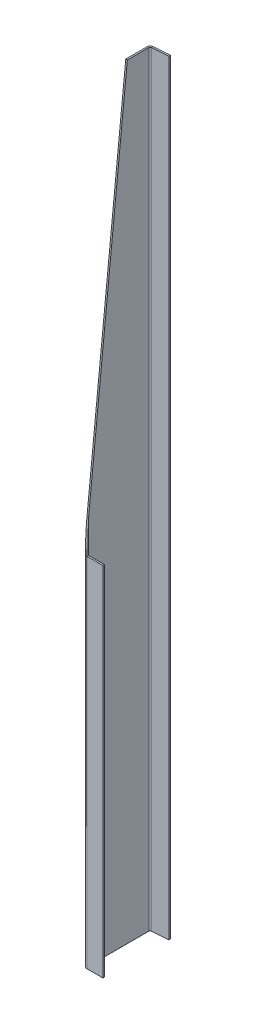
ISO-10303-21;
HEADER;
FILE_DESCRIPTION(('STEP AP214'),'2;1');
FILE_NAME('part.step','',(''),(''),'','','');
FILE_SCHEMA(('AUTOMOTIVE_DESIGN { 1 0 10303 214 1 1 1 1 }'));
ENDSEC;
DATA;
#1=APPLICATION_CONTEXT('core data for automotive mechanical design processes');
#2=APPLICATION_PROTOCOL_DEFINITION('international standard','automotive_design',2000,#1);
#3=PRODUCT_CONTEXT('',#1,'mechanical');
#4=PRODUCT('Part','Part','',(#3));
#5=PRODUCT_RELATED_PRODUCT_CATEGORY('part','',(#4));
#6=PRODUCT_DEFINITION_FORMATION('','',#4);
#7=PRODUCT_DEFINITION_CONTEXT('part definition',#1,'design');
#8=PRODUCT_DEFINITION('design','',#6,#7);
#9=PRODUCT_DEFINITION_SHAPE('','',#8);
#10=(LENGTH_UNIT() NAMED_UNIT(*) SI_UNIT(.MILLI.,.METRE.));
#11=(NAMED_UNIT(*) PLANE_ANGLE_UNIT() SI_UNIT($,.RADIAN.));
#12=(NAMED_UNIT(*) SI_UNIT($,.STERADIAN.) SOLID_ANGLE_UNIT());
#13=UNCERTAINTY_MEASURE_WITH_UNIT(LENGTH_MEASURE(1.E-05),#10,'distance_accuracy_value','');
#14=(GEOMETRIC_REPRESENTATION_CONTEXT(3) GLOBAL_UNCERTAINTY_ASSIGNED_CONTEXT((#13)) GLOBAL_UNIT_ASSIGNED_CONTEXT((#10,
#11,#12)) REPRESENTATION_CONTEXT('',''));
#15=CARTESIAN_POINT('',(0.,0.,0.));
#16=DIRECTION('',(0.,0.,1.));
#17=DIRECTION('',(1.,0.,0.));
#18=AXIS2_PLACEMENT_3D('',#15,#16,#17);
#19=CARTESIAN_POINT('',(12.7,3048.,-6.35));
#20=DIRECTION('',(0.,1.,0.));
#21=DIRECTION('',(0.,0.,1.));
#22=AXIS2_PLACEMENT_3D('',#19,#20,#21);
#23=PLANE('',#22);
#24=DIRECTION('',(0.,0.,-1.));
#25=VECTOR('',#24,1.);
#26=CARTESIAN_POINT('',(0.,3048.,0.));
#27=LINE('',#26,#25);
#28=CARTESIAN_POINT('',(0.,3048.,-167.240443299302));
#29=VERTEX_POINT('',#28);
#30=CARTESIAN_POINT('',(0.,3048.,-251.682058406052));
#31=VERTEX_POINT('',#30);
#32=EDGE_CURVE('E131',#29,#31,#27,.T.);
#33=ORIENTED_EDGE('',*,*,#32,.F.);
#34=DIRECTION('',(-1.,0.,0.));
#35=VECTOR('',#34,1.);
#36=CARTESIAN_POINT('',(0.,3048.,-167.240443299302));
#37=LINE('',#36,#35);
#38=CARTESIAN_POINT('',(6.35,3048.,-167.240443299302));
#39=VERTEX_POINT('',#38);
#40=EDGE_CURVE('E282',#29,#39,#37,.F.);
#41=ORIENTED_EDGE('',*,*,#40,.T.);
#42=DIRECTION('',(0.,0.,-1.));
#43=VECTOR('',#42,1.);
#44=CARTESIAN_POINT('',(6.35,3048.,0.));
#45=LINE('',#44,#43);
#46=CARTESIAN_POINT('',(6.35,3048.,-251.682058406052));
#47=VERTEX_POINT('',#46);
#48=EDGE_CURVE('E142',#39,#47,#45,.T.);
#49=ORIENTED_EDGE('',*,*,#48,.T.);
#50=DIRECTION('',(-1.,0.,0.));
#51=VECTOR('',#50,1.);
#52=CARTESIAN_POINT('',(6.35,3048.,-251.682058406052));
#53=LINE('',#52,#51);
#54=EDGE_CURVE('E146',#47,#31,#53,.T.);
#55=ORIENTED_EDGE('',*,*,#54,.T.);
#56=EDGE_LOOP('',(#33,#41,#49,#55));
#57=FACE_BOUND('',#56,.T.);
#58=ADVANCED_FACE('F42',(#57),#23,.T.);
#59=CARTESIAN_POINT('',(0.,3048.,0.));
#60=DIRECTION('',(-1.,0.,0.));
#61=DIRECTION('',(0.,0.,1.));
#62=AXIS2_PLACEMENT_3D('',#59,#60,#61);
#63=PLANE('',#62);
#64=DIRECTION('',(0.,-1.,0.));
#65=VECTOR('',#64,1.);
#66=CARTESIAN_POINT('',(0.,3048.,-12.7));
#67=LINE('',#66,#65);
#68=CARTESIAN_POINT('',(0.,1546.13428280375,-12.7000000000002));
#69=VERTEX_POINT('',#68);
#70=CARTESIAN_POINT('',(0.,0.,-12.7));
#71=VERTEX_POINT('',#70);
#72=EDGE_CURVE('E160',#69,#71,#67,.T.);
#73=ORIENTED_EDGE('',*,*,#72,.F.);
#74=DIRECTION('',(0.,-0.994747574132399,0.102358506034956));
#75=VECTOR('',#74,1.);
#76=CARTESIAN_POINT('',(0.,1422.71225682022,0.));
#77=LINE('',#76,#75);
#78=EDGE_CURVE('E139',#29,#69,#77,.T.);
#79=ORIENTED_EDGE('',*,*,#78,.F.);
#80=ORIENTED_EDGE('',*,*,#32,.T.);
#81=DIRECTION('',(0.,-1.,0.));
#82=VECTOR('',#81,1.);
#83=CARTESIAN_POINT('',(0.,3048.,-251.682058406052));
#84=LINE('',#83,#82);
#85=CARTESIAN_POINT('',(0.,0.,-251.682058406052));
#86=VERTEX_POINT('',#85);
#87=EDGE_CURVE('E137',#31,#86,#84,.T.);
#88=ORIENTED_EDGE('',*,*,#87,.T.);
#89=DIRECTION('',(0.,0.,-1.));
#90=VECTOR('',#89,1.);
#91=CARTESIAN_POINT('',(0.,0.,0.));
#92=LINE('',#91,#90);
#93=EDGE_CURVE('E185',#71,#86,#92,.T.);
#94=ORIENTED_EDGE('',*,*,#93,.F.);
#95=EDGE_LOOP('',(#73,#79,#80,#88,#94));
#96=FACE_BOUND('',#95,.T.);
#97=ADVANCED_FACE('F134',(#96),#63,.T.);
#98=CARTESIAN_POINT('',(12.7,3048.,-12.7));
#99=DIRECTION('',(0.,-1.,0.));
#100=DIRECTION('',(0.,0.,-1.));
#101=AXIS2_PLACEMENT_3D('',#98,#99,#100);
#102=CYLINDRICAL_SURFACE('',#101,12.7);
#103=DIRECTION('',(0.,-1.,0.));
#104=VECTOR('',#103,1.);
#105=CARTESIAN_POINT('',(12.7000000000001,3048.,0.));
#106=LINE('',#105,#104);
#107=CARTESIAN_POINT('',(12.7000000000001,1422.71225682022,0.));
#108=VERTEX_POINT('',#107);
#109=CARTESIAN_POINT('',(12.7000000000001,0.,0.));
#110=VERTEX_POINT('',#109);
#111=EDGE_CURVE('E220',#108,#110,#106,.T.);
#112=ORIENTED_EDGE('',*,*,#111,.F.);
#113=CARTESIAN_POINT('',(12.7,1546.13428280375,-12.7));
#114=DIRECTION('',(0.,-0.102358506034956,-0.994747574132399));
#115=DIRECTION('',(0.,-0.994747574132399,0.102358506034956));
#116=AXIS2_PLACEMENT_3D('',#113,#114,#115);
#117=ELLIPSE('',#116,124.073713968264,12.7);
#118=EDGE_CURVE('E271',#69,#108,#117,.F.);
#119=ORIENTED_EDGE('',*,*,#118,.F.);
#120=ORIENTED_EDGE('',*,*,#72,.T.);
#121=CARTESIAN_POINT('',(12.7,0.,-12.7));
#122=DIRECTION('',(0.,1.,0.));
#123=DIRECTION('',(0.,0.,1.));
#124=AXIS2_PLACEMENT_3D('',#121,#122,#123);
#125=CIRCLE('',#124,12.7);
#126=EDGE_CURVE('E187',#110,#71,#125,.F.);
#127=ORIENTED_EDGE('',*,*,#126,.F.);
#128=EDGE_LOOP('',(#112,#119,#120,#127));
#129=FACE_BOUND('',#128,.T.);
#130=ADVANCED_FACE('F243',(#129),#102,.T.);
#131=CARTESIAN_POINT('',(76.2,3048.,0.));
#132=DIRECTION('',(0.,0.,1.));
#133=DIRECTION('',(1.,0.,0.));
#134=AXIS2_PLACEMENT_3D('',#131,#132,#133);
#135=PLANE('',#134);
#136=DIRECTION('',(0.,-1.,0.));
#137=VECTOR('',#136,1.);
#138=CARTESIAN_POINT('',(76.2,3048.,0.));
#139=LINE('',#138,#137);
#140=CARTESIAN_POINT('',(76.2,1422.71225682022,0.));
#141=VERTEX_POINT('',#140);
#142=CARTESIAN_POINT('',(76.2,0.,0.));
#143=VERTEX_POINT('',#142);
#144=EDGE_CURVE('E218',#141,#143,#139,.T.);
#145=ORIENTED_EDGE('',*,*,#144,.F.);
#146=DIRECTION('',(-1.,0.,0.));
#147=VECTOR('',#146,1.);
#148=CARTESIAN_POINT('',(76.4573342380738,1422.71225682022,0.));
#149=LINE('',#148,#147);
#150=EDGE_CURVE('E257',#141,#108,#149,.T.);
#151=ORIENTED_EDGE('',*,*,#150,.T.);
#152=ORIENTED_EDGE('',*,*,#111,.T.);
#153=DIRECTION('',(-1.,0.,0.));
#154=VECTOR('',#153,1.);
#155=CARTESIAN_POINT('',(76.2,0.,0.));
#156=LINE('',#155,#154);
#157=EDGE_CURVE('E190',#143,#110,#156,.T.);
#158=ORIENTED_EDGE('',*,*,#157,.F.);
#159=EDGE_LOOP('',(#145,#151,#152,#158));
#160=FACE_BOUND('',#159,.T.);
#161=ADVANCED_FACE('F253',(#160),#135,.T.);
#162=CARTESIAN_POINT('',(76.2,3048.,-6.35));
#163=DIRECTION('',(1.,0.,0.));
#164=DIRECTION('',(0.,0.,-1.));
#165=AXIS2_PLACEMENT_3D('',#162,#163,#164);
#166=PLANE('',#165);
#167=DIRECTION('',(0.,-1.,0.));
#168=VECTOR('',#167,1.);
#169=CARTESIAN_POINT('',(76.2,3048.,-6.35));
#170=LINE('',#169,#168);
#171=CARTESIAN_POINT('',(76.2,1422.71225682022,-6.35));
#172=VERTEX_POINT('',#171);
#173=CARTESIAN_POINT('',(76.2,0.,-6.35));
#174=VERTEX_POINT('',#173);
#175=EDGE_CURVE('E216',#172,#174,#170,.T.);
#176=ORIENTED_EDGE('',*,*,#175,.F.);
#177=DIRECTION('',(0.,0.,1.));
#178=VECTOR('',#177,1.);
#179=CARTESIAN_POINT('',(76.2,1422.71225682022,0.));
#180=LINE('',#179,#178);
#181=EDGE_CURVE('E275',#141,#172,#180,.F.);
#182=ORIENTED_EDGE('',*,*,#181,.F.);
#183=ORIENTED_EDGE('',*,*,#144,.T.);
#184=DIRECTION('',(0.,0.,1.));
#185=VECTOR('',#184,1.);
#186=CARTESIAN_POINT('',(76.2,0.,-6.35));
#187=LINE('',#186,#185);
#188=EDGE_CURVE('E193',#174,#143,#187,.T.);
#189=ORIENTED_EDGE('',*,*,#188,.F.);
#190=EDGE_LOOP('',(#176,#182,#183,#189));
#191=FACE_BOUND('',#190,.T.);
#192=ADVANCED_FACE('F360',(#191),#166,.T.);
#193=CARTESIAN_POINT('',(76.2,3048.,-6.35));
#194=DIRECTION('',(0.,0.,1.));
#195=DIRECTION('',(1.,0.,0.));
#196=AXIS2_PLACEMENT_3D('',#193,#194,#195);
#197=PLANE('',#196);
#198=DIRECTION('',(1.,0.,0.));
#199=VECTOR('',#198,1.);
#200=CARTESIAN_POINT('',(76.2,1422.71225682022,-6.35));
#201=LINE('',#200,#199);
#202=CARTESIAN_POINT('',(12.7000000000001,1422.71225682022,-6.35));
#203=VERTEX_POINT('',#202);
#204=EDGE_CURVE('E264',#172,#203,#201,.F.);
#205=ORIENTED_EDGE('',*,*,#204,.F.);
#206=ORIENTED_EDGE('',*,*,#175,.T.);
#207=DIRECTION('',(-1.,0.,0.));
#208=VECTOR('',#207,1.);
#209=CARTESIAN_POINT('',(76.2,0.,-6.35));
#210=LINE('',#209,#208);
#211=CARTESIAN_POINT('',(12.7,0.,-6.35));
#212=VERTEX_POINT('',#211);
#213=EDGE_CURVE('E196',#174,#212,#210,.T.);
#214=ORIENTED_EDGE('',*,*,#213,.T.);
#215=DIRECTION('',(0.,-1.,0.));
#216=VECTOR('',#215,1.);
#217=CARTESIAN_POINT('',(12.7,3048.,-6.35));
#218=LINE('',#217,#216);
#219=EDGE_CURVE('E214',#203,#212,#218,.T.);
#220=ORIENTED_EDGE('',*,*,#219,.F.);
#221=EDGE_LOOP('',(#205,#206,#214,#220));
#222=FACE_BOUND('',#221,.T.);
#223=ADVANCED_FACE('F354',(#222),#197,.F.);
#224=CARTESIAN_POINT('',(12.7,3048.,-12.7));
#225=DIRECTION('',(0.,-1.,0.));
#226=DIRECTION('',(0.,0.,-1.));
#227=AXIS2_PLACEMENT_3D('',#224,#225,#226);
#228=CYLINDRICAL_SURFACE('',#227,6.35);
#229=CARTESIAN_POINT('',(12.7,1546.13428280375,-12.7));
#230=DIRECTION('',(0.,-0.0513815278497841,-0.998679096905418));
#231=DIRECTION('',(0.,-0.998679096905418,0.0513815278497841));
#232=AXIS2_PLACEMENT_3D('',#229,#230,#231);
#233=ELLIPSE('',#232,123.585270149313,6.35);
#234=CARTESIAN_POINT('',(6.35,1546.13428280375,-12.7));
#235=VERTEX_POINT('',#234);
#236=EDGE_CURVE('E265',#235,#203,#233,.F.);
#237=ORIENTED_EDGE('',*,*,#236,.T.);
#238=ORIENTED_EDGE('',*,*,#219,.T.);
#239=CARTESIAN_POINT('',(12.7,0.,-12.7));
#240=DIRECTION('',(0.,1.,0.));
#241=DIRECTION('',(1.,0.,0.));
#242=AXIS2_PLACEMENT_3D('',#239,#240,#241);
#243=CIRCLE('',#242,6.35);
#244=CARTESIAN_POINT('',(6.35,0.,-12.7));
#245=VERTEX_POINT('',#244);
#246=EDGE_CURVE('E199',#212,#245,#243,.F.);
#247=ORIENTED_EDGE('',*,*,#246,.T.);
#248=DIRECTION('',(0.,-1.,0.));
#249=VECTOR('',#248,1.);
#250=CARTESIAN_POINT('',(6.35,3048.,-12.7));
#251=LINE('',#250,#249);
#252=EDGE_CURVE('E212',#235,#245,#251,.T.);
#253=ORIENTED_EDGE('',*,*,#252,.F.);
#254=EDGE_LOOP('',(#237,#238,#247,#253));
#255=FACE_BOUND('',#254,.T.);
#256=ADVANCED_FACE('F349',(#255),#228,.F.);
#257=CARTESIAN_POINT('',(6.35,3048.,0.));
#258=DIRECTION('',(-1.,0.,0.));
#259=DIRECTION('',(0.,0.,1.));
#260=AXIS2_PLACEMENT_3D('',#257,#258,#259);
#261=PLANE('',#260);
#262=DIRECTION('',(0.,-0.994747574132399,0.102358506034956));
#263=VECTOR('',#262,1.);
#264=CARTESIAN_POINT('',(6.35,1422.71225682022,0.));
#265=LINE('',#264,#263);
#266=EDGE_CURVE('E279',#39,#235,#265,.T.);
#267=ORIENTED_EDGE('',*,*,#266,.T.);
#268=ORIENTED_EDGE('',*,*,#252,.T.);
#269=DIRECTION('',(0.,0.,-1.));
#270=VECTOR('',#269,1.);
#271=CARTESIAN_POINT('',(6.35,0.,0.));
#272=LINE('',#271,#270);
#273=CARTESIAN_POINT('',(6.35,0.,-251.682058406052));
#274=VERTEX_POINT('',#273);
#275=EDGE_CURVE('E202',#245,#274,#272,.T.);
#276=ORIENTED_EDGE('',*,*,#275,.T.);
#277=DIRECTION('',(0.,-1.,0.));
#278=VECTOR('',#277,1.);
#279=CARTESIAN_POINT('',(6.35,3048.,-251.682058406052));
#280=LINE('',#279,#278);
#281=EDGE_CURVE('E209',#47,#274,#280,.T.);
#282=ORIENTED_EDGE('',*,*,#281,.F.);
#283=ORIENTED_EDGE('',*,*,#48,.F.);
#284=EDGE_LOOP('',(#267,#268,#276,#282,#283));
#285=FACE_BOUND('',#284,.T.);
#286=ADVANCED_FACE('F297',(#285),#261,.F.);
#287=CARTESIAN_POINT('',(12.7000000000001,0.,0.));
#288=DIRECTION('',(0.,-1.,0.));
#289=DIRECTION('',(0.,0.,-1.));
#290=AXIS2_PLACEMENT_3D('',#287,#288,#289);
#291=PLANE('',#290);
#292=DIRECTION('',(0.,0.,-1.));
#293=VECTOR('',#292,1.);
#294=CARTESIAN_POINT('',(12.7000000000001,0.,0.));
#295=LINE('',#294,#293);
#296=EDGE_CURVE('E11',#110,#212,#295,.T.);
#297=ORIENTED_EDGE('',*,*,#296,.F.);
#298=ORIENTED_EDGE('',*,*,#126,.T.);
#299=DIRECTION('',(-1.,0.,0.));
#300=VECTOR('',#299,1.);
#301=CARTESIAN_POINT('',(6.35,0.,-12.7));
#302=LINE('',#301,#300);
#303=EDGE_CURVE('E49',#245,#71,#302,.T.);
#304=ORIENTED_EDGE('',*,*,#303,.F.);
#305=ORIENTED_EDGE('',*,*,#246,.F.);
#306=EDGE_LOOP('',(#297,#298,#304,#305));
#307=FACE_BOUND('',#306,.T.);
#308=ADVANCED_FACE('F240',(#307),#291,.T.);
#309=CARTESIAN_POINT('',(6.35,0.,-12.7));
#310=DIRECTION('',(0.,-1.,0.));
#311=DIRECTION('',(0.,0.,-1.));
#312=AXIS2_PLACEMENT_3D('',#309,#310,#311);
#313=PLANE('',#312);
#314=ORIENTED_EDGE('',*,*,#157,.T.);
#315=ORIENTED_EDGE('',*,*,#296,.T.);
#316=ORIENTED_EDGE('',*,*,#213,.F.);
#317=ORIENTED_EDGE('',*,*,#188,.T.);
#318=EDGE_LOOP('',(#314,#315,#316,#317));
#319=FACE_BOUND('',#318,.T.);
#320=ADVANCED_FACE('F248',(#319),#313,.T.);
#321=CARTESIAN_POINT('',(11.8140927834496,3048.,-264.351121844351));
#322=DIRECTION('',(0.,1.,0.));
#323=DIRECTION('',(0.,0.,1.));
#324=AXIS2_PLACEMENT_3D('',#321,#322,#323);
#325=PLANE('',#324);
#326=DIRECTION('',(0.0697564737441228,0.,0.997564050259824));
#327=VECTOR('',#326,1.);
#328=CARTESIAN_POINT('',(11.8140927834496,3048.,-264.351121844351));
#329=LINE('',#328,#327);
#330=CARTESIAN_POINT('',(11.8140927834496,3048.,-264.351121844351));
#331=VERTEX_POINT('',#330);
#332=CARTESIAN_POINT('',(12.2570463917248,3048.,-258.016590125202));
#333=VERTEX_POINT('',#332);
#334=EDGE_CURVE('E65',#331,#333,#329,.T.);
#335=ORIENTED_EDGE('',*,*,#334,.F.);
#336=CARTESIAN_POINT('',(12.7,3048.,-251.682058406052));
#337=DIRECTION('',(0.,1.,0.));
#338=DIRECTION('',(0.,0.,1.));
#339=AXIS2_PLACEMENT_3D('',#336,#337,#338);
#340=CIRCLE('',#339,12.7);
#341=EDGE_CURVE('E143',#31,#331,#340,.F.);
#342=ORIENTED_EDGE('',*,*,#341,.F.);
#343=ORIENTED_EDGE('',*,*,#54,.F.);
#344=CARTESIAN_POINT('',(12.7,3048.,-251.682058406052));
#345=DIRECTION('',(0.,1.,0.));
#346=DIRECTION('',(1.,0.,0.));
#347=AXIS2_PLACEMENT_3D('',#344,#345,#346);
#348=CIRCLE('',#347,6.35);
#349=EDGE_CURVE('E172',#47,#333,#348,.F.);
#350=ORIENTED_EDGE('',*,*,#349,.T.);
#351=EDGE_LOOP('',(#335,#342,#343,#350));
#352=FACE_BOUND('',#351,.T.);
#353=ADVANCED_FACE('F162',(#352),#325,.T.);
#354=CARTESIAN_POINT('',(6.35,3048.,-251.682058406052));
#355=DIRECTION('',(0.,1.,0.));
#356=DIRECTION('',(0.,0.,1.));
#357=AXIS2_PLACEMENT_3D('',#354,#355,#356);
#358=PLANE('',#357);
#359=DIRECTION('',(0.997564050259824,0.,-0.0697564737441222));
#360=VECTOR('',#359,1.);
#361=CARTESIAN_POINT('',(0.,3048.,-263.525));
#362=LINE('',#361,#360);
#363=CARTESIAN_POINT('',(76.0143806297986,3048.,-268.840443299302));
#364=VERTEX_POINT('',#363);
#365=EDGE_CURVE('E164',#331,#364,#362,.T.);
#366=ORIENTED_EDGE('',*,*,#365,.F.);
#367=ORIENTED_EDGE('',*,*,#334,.T.);
#368=DIRECTION('',(0.997564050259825,0.,-0.0697564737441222));
#369=VECTOR('',#368,1.);
#370=CARTESIAN_POINT('',(0.442953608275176,3048.,-257.19046828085));
#371=LINE('',#370,#369);
#372=CARTESIAN_POINT('',(76.4573342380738,3048.,-262.505911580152));
#373=VERTEX_POINT('',#372);
#374=EDGE_CURVE('E117',#333,#373,#371,.T.);
#375=ORIENTED_EDGE('',*,*,#374,.T.);
#376=DIRECTION('',(0.0697564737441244,0.,0.997564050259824));
#377=VECTOR('',#376,1.);
#378=CARTESIAN_POINT('',(76.0143806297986,3048.,-268.840443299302));
#379=LINE('',#378,#377);
#380=EDGE_CURVE('E167',#364,#373,#379,.T.);
#381=ORIENTED_EDGE('',*,*,#380,.F.);
#382=EDGE_LOOP('',(#366,#367,#375,#381));
#383=FACE_BOUND('',#382,.T.);
#384=ADVANCED_FACE('F290',(#383),#358,.T.);
#385=CARTESIAN_POINT('',(0.,0.,-251.682058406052));
#386=DIRECTION('',(0.,-1.,0.));
#387=DIRECTION('',(0.,0.,-1.));
#388=AXIS2_PLACEMENT_3D('',#385,#386,#387);
#389=PLANE('',#388);
#390=DIRECTION('',(1.,0.,0.));
#391=VECTOR('',#390,1.);
#392=CARTESIAN_POINT('',(0.,0.,-251.682058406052));
#393=LINE('',#392,#391);
#394=EDGE_CURVE('E151',#86,#274,#393,.T.);
#395=ORIENTED_EDGE('',*,*,#394,.F.);
#396=CARTESIAN_POINT('',(12.7,0.,-251.682058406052));
#397=DIRECTION('',(0.,1.,0.));
#398=DIRECTION('',(0.,0.,1.));
#399=AXIS2_PLACEMENT_3D('',#396,#397,#398);
#400=CIRCLE('',#399,12.7);
#401=CARTESIAN_POINT('',(11.8140927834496,0.,-264.351121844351));
#402=VERTEX_POINT('',#401);
#403=EDGE_CURVE('E157',#86,#402,#400,.F.);
#404=ORIENTED_EDGE('',*,*,#403,.T.);
#405=DIRECTION('',(-0.0697564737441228,0.,-0.997564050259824));
#406=VECTOR('',#405,1.);
#407=CARTESIAN_POINT('',(12.2570463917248,0.,-258.016590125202));
#408=LINE('',#407,#406);
#409=CARTESIAN_POINT('',(12.2570463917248,0.,-258.016590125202));
#410=VERTEX_POINT('',#409);
#411=EDGE_CURVE('E111',#410,#402,#408,.T.);
#412=ORIENTED_EDGE('',*,*,#411,.F.);
#413=CARTESIAN_POINT('',(12.7,0.,-251.682058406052));
#414=DIRECTION('',(0.,1.,0.));
#415=DIRECTION('',(1.,0.,0.));
#416=AXIS2_PLACEMENT_3D('',#413,#414,#415);
#417=CIRCLE('',#416,6.35);
#418=EDGE_CURVE('E205',#274,#410,#417,.F.);
#419=ORIENTED_EDGE('',*,*,#418,.F.);
#420=EDGE_LOOP('',(#395,#404,#412,#419));
#421=FACE_BOUND('',#420,.T.);
#422=ADVANCED_FACE('F295',(#421),#389,.T.);
#423=CARTESIAN_POINT('',(12.2570463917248,0.,-258.016590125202));
#424=DIRECTION('',(0.,-1.,0.));
#425=DIRECTION('',(0.,0.,-1.));
#426=AXIS2_PLACEMENT_3D('',#423,#424,#425);
#427=PLANE('',#426);
#428=ORIENTED_EDGE('',*,*,#93,.T.);
#429=ORIENTED_EDGE('',*,*,#394,.T.);
#430=ORIENTED_EDGE('',*,*,#275,.F.);
#431=ORIENTED_EDGE('',*,*,#303,.T.);
#432=EDGE_LOOP('',(#428,#429,#430,#431));
#433=FACE_BOUND('',#432,.T.);
#434=ADVANCED_FACE('F234',(#433),#427,.T.);
#435=CARTESIAN_POINT('',(0.442953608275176,3048.,-257.19046828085));
#436=DIRECTION('',(-0.0697564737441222,0.,-0.997564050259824));
#437=DIRECTION('',(-0.997564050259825,0.,0.0697564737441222));
#438=AXIS2_PLACEMENT_3D('',#435,#436,#437);
#439=PLANE('',#438);
#440=DIRECTION('',(0.997564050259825,0.,-0.0697564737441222));
#441=VECTOR('',#440,1.);
#442=CARTESIAN_POINT('',(0.442953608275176,0.,-257.19046828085));
#443=LINE('',#442,#441);
#444=CARTESIAN_POINT('',(76.4573342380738,0.,-262.505911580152));
#445=VERTEX_POINT('',#444);
#446=EDGE_CURVE('E175',#410,#445,#443,.T.);
#447=ORIENTED_EDGE('',*,*,#446,.T.);
#448=DIRECTION('',(0.,-1.,0.));
#449=VECTOR('',#448,1.);
#450=CARTESIAN_POINT('',(76.4573342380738,3048.,-262.505911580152));
#451=LINE('',#450,#449);
#452=EDGE_CURVE('E226',#373,#445,#451,.T.);
#453=ORIENTED_EDGE('',*,*,#452,.F.);
#454=ORIENTED_EDGE('',*,*,#374,.F.);
#455=DIRECTION('',(0.,-1.,0.));
#456=VECTOR('',#455,1.);
#457=CARTESIAN_POINT('',(12.2570463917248,3048.,-258.016590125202));
#458=LINE('',#457,#456);
#459=EDGE_CURVE('E174',#333,#410,#458,.T.);
#460=ORIENTED_EDGE('',*,*,#459,.T.);
#461=EDGE_LOOP('',(#447,#453,#454,#460));
#462=FACE_BOUND('',#461,.T.);
#463=ADVANCED_FACE('F305',(#462),#439,.F.);
#464=CARTESIAN_POINT('',(76.0143806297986,3048.,-268.840443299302));
#465=DIRECTION('',(0.997564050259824,0.,-0.0697564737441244));
#466=DIRECTION('',(-0.0697564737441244,0.,-0.997564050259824));
#467=AXIS2_PLACEMENT_3D('',#464,#465,#466);
#468=PLANE('',#467);
#469=DIRECTION('',(0.0697564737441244,0.,0.997564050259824));
#470=VECTOR('',#469,1.);
#471=CARTESIAN_POINT('',(76.0143806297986,0.,-268.840443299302));
#472=LINE('',#471,#470);
#473=CARTESIAN_POINT('',(76.0143806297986,0.,-268.840443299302));
#474=VERTEX_POINT('',#473);
#475=EDGE_CURVE('E178',#474,#445,#472,.T.);
#476=ORIENTED_EDGE('',*,*,#475,.F.);
#477=DIRECTION('',(0.,-1.,0.));
#478=VECTOR('',#477,1.);
#479=CARTESIAN_POINT('',(76.0143806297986,3048.,-268.840443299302));
#480=LINE('',#479,#478);
#481=EDGE_CURVE('E224',#364,#474,#480,.T.);
#482=ORIENTED_EDGE('',*,*,#481,.F.);
#483=ORIENTED_EDGE('',*,*,#380,.T.);
#484=ORIENTED_EDGE('',*,*,#452,.T.);
#485=EDGE_LOOP('',(#476,#482,#483,#484));
#486=FACE_BOUND('',#485,.T.);
#487=ADVANCED_FACE('F289',(#486),#468,.T.);
#488=CARTESIAN_POINT('',(0.,3048.,-263.525));
#489=DIRECTION('',(-0.0697564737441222,0.,-0.997564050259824));
#490=DIRECTION('',(-0.997564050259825,0.,0.0697564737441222));
#491=AXIS2_PLACEMENT_3D('',#488,#489,#490);
#492=PLANE('',#491);
#493=DIRECTION('',(0.997564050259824,0.,-0.0697564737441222));
#494=VECTOR('',#493,1.);
#495=CARTESIAN_POINT('',(0.,0.,-263.525));
#496=LINE('',#495,#494);
#497=EDGE_CURVE('E181',#402,#474,#496,.T.);
#498=ORIENTED_EDGE('',*,*,#497,.F.);
#499=DIRECTION('',(0.,-1.,0.));
#500=VECTOR('',#499,1.);
#501=CARTESIAN_POINT('',(11.8140927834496,3048.,-264.351121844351));
#502=LINE('',#501,#500);
#503=EDGE_CURVE('E159',#331,#402,#502,.T.);
#504=ORIENTED_EDGE('',*,*,#503,.F.);
#505=ORIENTED_EDGE('',*,*,#365,.T.);
#506=ORIENTED_EDGE('',*,*,#481,.T.);
#507=EDGE_LOOP('',(#498,#504,#505,#506));
#508=FACE_BOUND('',#507,.T.);
#509=ADVANCED_FACE('F293',(#508),#492,.T.);
#510=CARTESIAN_POINT('',(12.7,3048.,-251.682058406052));
#511=DIRECTION('',(0.,-1.,0.));
#512=DIRECTION('',(0.,0.,-1.));
#513=AXIS2_PLACEMENT_3D('',#510,#511,#512);
#514=CYLINDRICAL_SURFACE('',#513,12.7);
#515=ORIENTED_EDGE('',*,*,#403,.F.);
#516=ORIENTED_EDGE('',*,*,#87,.F.);
#517=ORIENTED_EDGE('',*,*,#341,.T.);
#518=ORIENTED_EDGE('',*,*,#503,.T.);
#519=EDGE_LOOP('',(#515,#516,#517,#518));
#520=FACE_BOUND('',#519,.T.);
#521=ADVANCED_FACE('F155',(#520),#514,.T.);
#522=CARTESIAN_POINT('',(12.7,3048.,-251.682058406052));
#523=DIRECTION('',(0.,-1.,0.));
#524=DIRECTION('',(0.,0.,-1.));
#525=AXIS2_PLACEMENT_3D('',#522,#523,#524);
#526=CYLINDRICAL_SURFACE('',#525,6.35);
#527=ORIENTED_EDGE('',*,*,#418,.T.);
#528=ORIENTED_EDGE('',*,*,#459,.F.);
#529=ORIENTED_EDGE('',*,*,#349,.F.);
#530=ORIENTED_EDGE('',*,*,#281,.T.);
#531=EDGE_LOOP('',(#527,#528,#529,#530));
#532=FACE_BOUND('',#531,.T.);
#533=ADVANCED_FACE('F301',(#532),#526,.F.);
#534=CARTESIAN_POINT('',(12.7,0.,-251.682058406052));
#535=DIRECTION('',(0.,1.,0.));
#536=DIRECTION('',(1.,0.,0.));
#537=AXIS2_PLACEMENT_3D('',#534,#535,#536);
#538=PLANE('',#537);
#539=ORIENTED_EDGE('',*,*,#446,.F.);
#540=ORIENTED_EDGE('',*,*,#411,.T.);
#541=ORIENTED_EDGE('',*,*,#497,.T.);
#542=ORIENTED_EDGE('',*,*,#475,.T.);
#543=EDGE_LOOP('',(#539,#540,#541,#542));
#544=FACE_BOUND('',#543,.T.);
#545=ADVANCED_FACE('F306',(#544),#538,.F.);
#546=CARTESIAN_POINT('',(0.,1422.71225682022,0.));
#547=DIRECTION('',(0.,-0.102358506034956,-0.994747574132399));
#548=DIRECTION('',(0.,-0.994747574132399,0.102358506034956));
#549=AXIS2_PLACEMENT_3D('',#546,#547,#548);
#550=PLANE('',#549);
#551=ORIENTED_EDGE('',*,*,#78,.T.);
#552=DIRECTION('',(-1.,0.,0.));
#553=VECTOR('',#552,1.);
#554=CARTESIAN_POINT('',(0.,1546.13428280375,-12.7000000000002));
#555=LINE('',#554,#553);
#556=EDGE_CURVE('E56',#69,#235,#555,.F.);
#557=ORIENTED_EDGE('',*,*,#556,.T.);
#558=ORIENTED_EDGE('',*,*,#266,.F.);
#559=ORIENTED_EDGE('',*,*,#40,.F.);
#560=EDGE_LOOP('',(#551,#557,#558,#559));
#561=FACE_BOUND('',#560,.T.);
#562=ADVANCED_FACE('F308',(#561),#550,.F.);
#563=CARTESIAN_POINT('',(76.4573342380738,1422.71225682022,0.));
#564=DIRECTION('',(0.,1.,0.));
#565=DIRECTION('',(-1.,0.,0.));
#566=AXIS2_PLACEMENT_3D('',#563,#564,#565);
#567=PLANE('',#566);
#568=ORIENTED_EDGE('',*,*,#150,.F.);
#569=ORIENTED_EDGE('',*,*,#181,.T.);
#570=ORIENTED_EDGE('',*,*,#204,.T.);
#571=DIRECTION('',(0.,0.,1.));
#572=VECTOR('',#571,1.);
#573=CARTESIAN_POINT('',(12.7000000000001,1422.71225682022,0.));
#574=LINE('',#573,#572);
#575=EDGE_CURVE('E268',#108,#203,#574,.F.);
#576=ORIENTED_EDGE('',*,*,#575,.F.);
#577=EDGE_LOOP('',(#568,#569,#570,#576));
#578=FACE_BOUND('',#577,.T.);
#579=ADVANCED_FACE('F314',(#578),#567,.T.);
#580=CARTESIAN_POINT('',(12.7,1422.71225682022,0.));
#581=CARTESIAN_POINT('',(12.7,1422.71225682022,-2.11666666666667));
#582=CARTESIAN_POINT('',(12.7,1422.71225682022,-4.23333333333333));
#583=CARTESIAN_POINT('',(12.7,1422.71225682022,-6.35));
#584=CARTESIAN_POINT('',(38.1,1422.71225682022,0.));
#585=CARTESIAN_POINT('',(33.8666666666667,1422.71225682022,-2.11666666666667));
#586=CARTESIAN_POINT('',(29.6333333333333,1422.71225682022,-4.23333333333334));
#587=CARTESIAN_POINT('',(25.4,1422.71225682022,-6.35));
#588=CARTESIAN_POINT('',(38.1,1669.55630878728,-25.4));
#589=CARTESIAN_POINT('',(33.8666666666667,1669.55630878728,-23.2833333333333));
#590=CARTESIAN_POINT('',(29.6333333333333,1669.55630878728,-21.1666666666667));
#591=CARTESIAN_POINT('',(25.4,1669.55630878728,-19.05));
#592=CARTESIAN_POINT('',(12.7,1669.55630878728,-25.4));
#593=CARTESIAN_POINT('',(12.7,1669.55630878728,-23.2833333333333));
#594=CARTESIAN_POINT('',(12.7,1669.55630878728,-21.1666666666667));
#595=CARTESIAN_POINT('',(12.7,1669.55630878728,-19.05));
#596=CARTESIAN_POINT('',(-12.7,1669.55630878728,-25.4));
#597=CARTESIAN_POINT('',(-8.46666666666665,1669.55630878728,-23.2833333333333));
#598=CARTESIAN_POINT('',(-4.23333333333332,1669.55630878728,-21.1666666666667));
#599=CARTESIAN_POINT('',(0.,1669.55630878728,-19.05));
#600=CARTESIAN_POINT('',(-12.7,1422.71225682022,0.));
#601=CARTESIAN_POINT('',(-8.46666666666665,1422.71225682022,-2.11666666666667));
#602=CARTESIAN_POINT('',(-4.23333333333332,1422.71225682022,-4.23333333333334));
#603=CARTESIAN_POINT('',(0.,1422.71225682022,-6.35));
#604=CARTESIAN_POINT('',(12.7,1422.71225682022,0.));
#605=CARTESIAN_POINT('',(12.7,1422.71225682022,-2.11666666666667));
#606=CARTESIAN_POINT('',(12.7,1422.71225682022,-4.23333333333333));
#607=CARTESIAN_POINT('',(12.7,1422.71225682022,-6.35));
#608=(BOUNDED_SURFACE() B_SPLINE_SURFACE(3,3,((#580,#581,#582,#583),(#584,#585,#586,#587),(#588,
#589,#590,#591),(#592,#593,#594,#595),(#596,#597,#598,#599),(#600,#601,#602,#603),(#604,#605,
#606,#607)),.UNSPECIFIED.,.T.,.F.,.F.) B_SPLINE_SURFACE_WITH_KNOTS((4,3,4),(4,4),(0.,0.5,1.),
(0.,1.),.UNSPECIFIED.) GEOMETRIC_REPRESENTATION_ITEM() RATIONAL_B_SPLINE_SURFACE(((1.,1.,1.,1.),
(0.333333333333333,0.333333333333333,0.333333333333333,0.333333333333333),(0.333333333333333,
0.333333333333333,0.333333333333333,0.333333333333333),(1.,1.,1.,1.),(0.333333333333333,
0.333333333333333,0.333333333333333,0.333333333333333),(0.333333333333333,0.333333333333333,
0.333333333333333,0.333333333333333),(1.,1.,1.,1.))) REPRESENTATION_ITEM('') SURFACE());
#609=ORIENTED_EDGE('',*,*,#118,.T.);
#610=ORIENTED_EDGE('',*,*,#575,.T.);
#611=ORIENTED_EDGE('',*,*,#236,.F.);
#612=ORIENTED_EDGE('',*,*,#556,.F.);
#613=EDGE_LOOP('',(#609,#610,#611,#612));
#614=FACE_BOUND('',#613,.T.);
#615=ADVANCED_FACE('F403',(#614),#608,.T.);
#616=CLOSED_SHELL('',(#58,#97,#130,#161,#192,#223,#256,#286,#308,#320,#353,#384,#422,#434,#463,
#487,#509,#521,#533,#545,#562,#579,#615));
#617=MANIFOLD_SOLID_BREP('B2',#616);
#618=ADVANCED_BREP_SHAPE_REPRESENTATION('',(#18,#617),#14);
#619=SHAPE_DEFINITION_REPRESENTATION(#9,#618);
ENDSEC;
END-ISO-10303-21;
